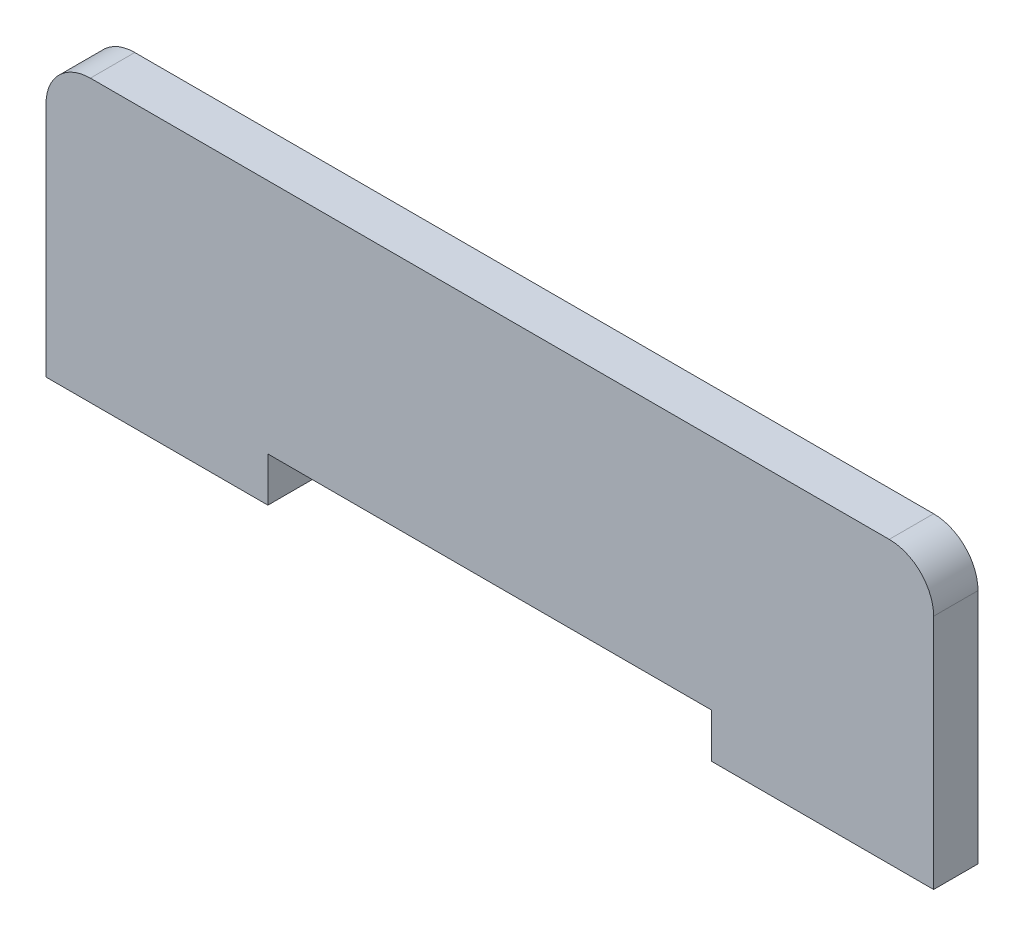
from build123d import *

# Parameters (mm, degrees)
BOSS_EXTRUDE1_DEPTH = 3
FILLET1_R           = 3


with BuildPart() as part:
    # Sketch1 → Boss-Extrude1 (new body)
    with BuildSketch(Plane.XY):
        Polygon((0, 0), (15, 0), (15, 3), (45, 3), (45, 0), (60, 0), (60, 3), (60, 19), (0, 19), (0, 3), align=None)
    extrude(amount=BOSS_EXTRUDE1_DEPTH)

    # Fillet1
    fillet1_edges = [part.edges().sort_by_distance(p)[0] for p in [
        (0, 19, 1.5),
        (60, 19, 1.5),
    ]]
    fillet(fillet1_edges, radius=FILLET1_R)


solid = part.part
